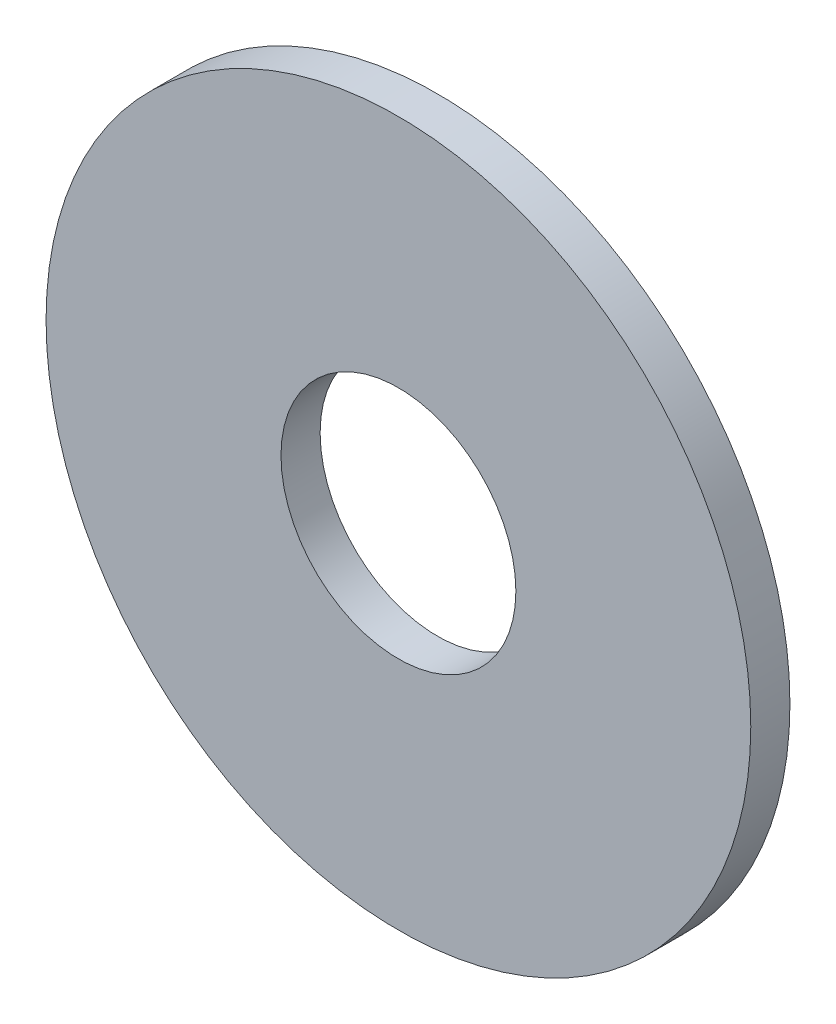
ISO-10303-21;
HEADER;
FILE_DESCRIPTION(('STEP AP214'),'2;1');
FILE_NAME('part.step','',(''),(''),'','','');
FILE_SCHEMA(('AUTOMOTIVE_DESIGN { 1 0 10303 214 1 1 1 1 }'));
ENDSEC;
DATA;
#1=APPLICATION_CONTEXT('core data for automotive mechanical design processes');
#2=APPLICATION_PROTOCOL_DEFINITION('international standard','automotive_design',2000,#1);
#3=PRODUCT_CONTEXT('',#1,'mechanical');
#4=PRODUCT('Part','Part','',(#3));
#5=PRODUCT_RELATED_PRODUCT_CATEGORY('part','',(#4));
#6=PRODUCT_DEFINITION_FORMATION('','',#4);
#7=PRODUCT_DEFINITION_CONTEXT('part definition',#1,'design');
#8=PRODUCT_DEFINITION('design','',#6,#7);
#9=PRODUCT_DEFINITION_SHAPE('','',#8);
#10=(LENGTH_UNIT() NAMED_UNIT(*) SI_UNIT(.MILLI.,.METRE.));
#11=(NAMED_UNIT(*) PLANE_ANGLE_UNIT() SI_UNIT($,.RADIAN.));
#12=(NAMED_UNIT(*) SI_UNIT($,.STERADIAN.) SOLID_ANGLE_UNIT());
#13=UNCERTAINTY_MEASURE_WITH_UNIT(LENGTH_MEASURE(1.E-05),#10,'distance_accuracy_value','');
#14=(GEOMETRIC_REPRESENTATION_CONTEXT(3) GLOBAL_UNCERTAINTY_ASSIGNED_CONTEXT((#13)) GLOBAL_UNIT_ASSIGNED_CONTEXT((#10,
#11,#12)) REPRESENTATION_CONTEXT('',''));
#15=CARTESIAN_POINT('',(0.,0.,0.));
#16=DIRECTION('',(0.,0.,1.));
#17=DIRECTION('',(1.,0.,0.));
#18=AXIS2_PLACEMENT_3D('',#15,#16,#17);
#19=CARTESIAN_POINT('',(0.,0.,0.));
#20=DIRECTION('',(0.,0.,-1.));
#21=DIRECTION('',(-1.,0.,0.));
#22=AXIS2_PLACEMENT_3D('',#19,#20,#21);
#23=PLANE('',#22);
#24=CARTESIAN_POINT('',(0.,0.,0.));
#25=DIRECTION('',(0.,0.,1.));
#26=DIRECTION('',(1.,0.,0.));
#27=AXIS2_PLACEMENT_3D('',#24,#25,#26);
#28=CIRCLE('',#27,18.);
#29=CARTESIAN_POINT('',(18.,0.,0.));
#30=VERTEX_POINT('',#29);
#31=EDGE_CURVE('E28',#30,#30,#28,.T.);
#32=ORIENTED_EDGE('',*,*,#31,.F.);
#33=EDGE_LOOP('',(#32));
#34=FACE_BOUND('',#33,.T.);
#35=CARTESIAN_POINT('',(0.,0.,0.));
#36=DIRECTION('',(0.,0.,1.));
#37=DIRECTION('',(1.,0.,0.));
#38=AXIS2_PLACEMENT_3D('',#35,#36,#37);
#39=CIRCLE('',#38,6.);
#40=CARTESIAN_POINT('',(6.,0.,0.));
#41=VERTEX_POINT('',#40);
#42=EDGE_CURVE('E19',#41,#41,#39,.T.);
#43=ORIENTED_EDGE('',*,*,#42,.T.);
#44=EDGE_LOOP('',(#43));
#45=FACE_BOUND('',#44,.T.);
#46=ADVANCED_FACE('F15',(#34,#45),#23,.T.);
#47=CARTESIAN_POINT('',(0.,0.,0.));
#48=DIRECTION('',(0.,0.,1.));
#49=DIRECTION('',(1.,0.,0.));
#50=AXIS2_PLACEMENT_3D('',#47,#48,#49);
#51=CYLINDRICAL_SURFACE('',#50,6.);
#52=CARTESIAN_POINT('',(0.,0.,2.));
#53=DIRECTION('',(0.,0.,1.));
#54=DIRECTION('',(1.,0.,0.));
#55=AXIS2_PLACEMENT_3D('',#52,#53,#54);
#56=CIRCLE('',#55,6.);
#57=CARTESIAN_POINT('',(6.,0.,2.));
#58=VERTEX_POINT('',#57);
#59=EDGE_CURVE('E23',#58,#58,#56,.T.);
#60=ORIENTED_EDGE('',*,*,#59,.T.);
#61=EDGE_LOOP('',(#60));
#62=FACE_BOUND('',#61,.T.);
#63=ORIENTED_EDGE('',*,*,#42,.F.);
#64=EDGE_LOOP('',(#63));
#65=FACE_BOUND('',#64,.T.);
#66=ADVANCED_FACE('F37',(#62,#65),#51,.F.);
#67=CARTESIAN_POINT('',(0.,0.,0.));
#68=DIRECTION('',(0.,0.,1.));
#69=DIRECTION('',(1.,0.,0.));
#70=AXIS2_PLACEMENT_3D('',#67,#68,#69);
#71=CYLINDRICAL_SURFACE('',#70,18.);
#72=ORIENTED_EDGE('',*,*,#31,.T.);
#73=EDGE_LOOP('',(#72));
#74=FACE_BOUND('',#73,.T.);
#75=CARTESIAN_POINT('',(0.,0.,2.));
#76=DIRECTION('',(0.,0.,1.));
#77=DIRECTION('',(1.,0.,0.));
#78=AXIS2_PLACEMENT_3D('',#75,#76,#77);
#79=CIRCLE('',#78,18.);
#80=CARTESIAN_POINT('',(18.,0.,2.));
#81=VERTEX_POINT('',#80);
#82=EDGE_CURVE('E10',#81,#81,#79,.F.);
#83=ORIENTED_EDGE('',*,*,#82,.T.);
#84=EDGE_LOOP('',(#83));
#85=FACE_BOUND('',#84,.T.);
#86=ADVANCED_FACE('F39',(#74,#85),#71,.T.);
#87=CARTESIAN_POINT('',(0.,0.,2.));
#88=DIRECTION('',(0.,0.,-1.));
#89=DIRECTION('',(-1.,0.,0.));
#90=AXIS2_PLACEMENT_3D('',#87,#88,#89);
#91=PLANE('',#90);
#92=ORIENTED_EDGE('',*,*,#82,.F.);
#93=EDGE_LOOP('',(#92));
#94=FACE_BOUND('',#93,.T.);
#95=ORIENTED_EDGE('',*,*,#59,.F.);
#96=EDGE_LOOP('',(#95));
#97=FACE_BOUND('',#96,.T.);
#98=ADVANCED_FACE('F17',(#94,#97),#91,.F.);
#99=CLOSED_SHELL('',(#46,#66,#86,#98));
#100=MANIFOLD_SOLID_BREP('B1',#99);
#101=ADVANCED_BREP_SHAPE_REPRESENTATION('',(#18,#100),#14);
#102=SHAPE_DEFINITION_REPRESENTATION(#9,#101);
ENDSEC;
END-ISO-10303-21;
